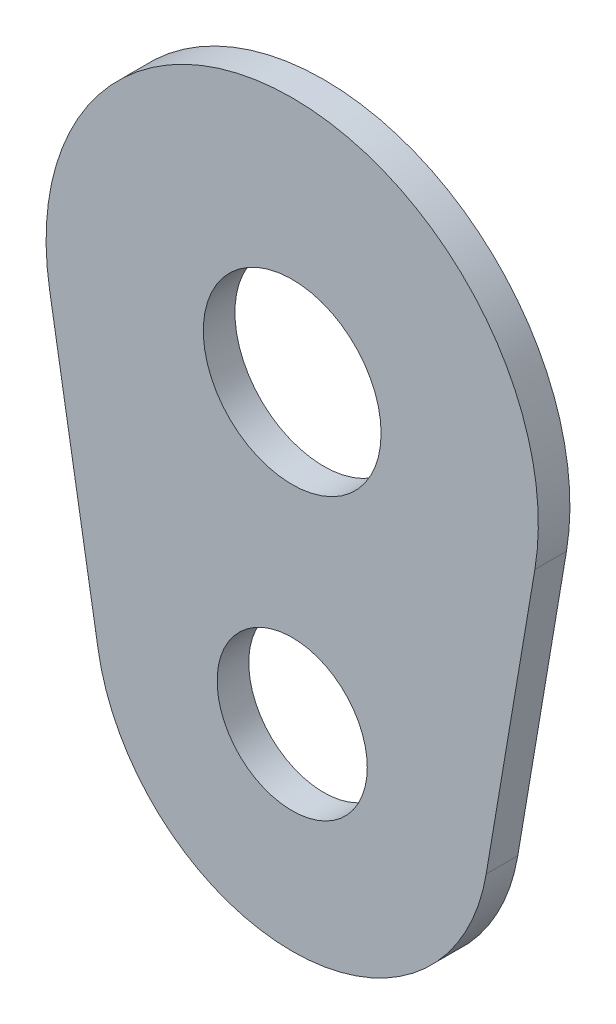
ISO-10303-21;
HEADER;
FILE_DESCRIPTION(('STEP AP214'),'2;1');
FILE_NAME('part.step','',(''),(''),'','','');
FILE_SCHEMA(('AUTOMOTIVE_DESIGN { 1 0 10303 214 1 1 1 1 }'));
ENDSEC;
DATA;
#1=APPLICATION_CONTEXT('core data for automotive mechanical design processes');
#2=APPLICATION_PROTOCOL_DEFINITION('international standard','automotive_design',2000,#1);
#3=PRODUCT_CONTEXT('',#1,'mechanical');
#4=PRODUCT('Part','Part','',(#3));
#5=PRODUCT_RELATED_PRODUCT_CATEGORY('part','',(#4));
#6=PRODUCT_DEFINITION_FORMATION('','',#4);
#7=PRODUCT_DEFINITION_CONTEXT('part definition',#1,'design');
#8=PRODUCT_DEFINITION('design','',#6,#7);
#9=PRODUCT_DEFINITION_SHAPE('','',#8);
#10=(LENGTH_UNIT() NAMED_UNIT(*) SI_UNIT(.MILLI.,.METRE.));
#11=(NAMED_UNIT(*) PLANE_ANGLE_UNIT() SI_UNIT($,.RADIAN.));
#12=(NAMED_UNIT(*) SI_UNIT($,.STERADIAN.) SOLID_ANGLE_UNIT());
#13=UNCERTAINTY_MEASURE_WITH_UNIT(LENGTH_MEASURE(1.E-05),#10,'distance_accuracy_value','');
#14=(GEOMETRIC_REPRESENTATION_CONTEXT(3) GLOBAL_UNCERTAINTY_ASSIGNED_CONTEXT((#13)) GLOBAL_UNIT_ASSIGNED_CONTEXT((#10,
#11,#12)) REPRESENTATION_CONTEXT('',''));
#15=CARTESIAN_POINT('',(0.,0.,0.));
#16=DIRECTION('',(0.,0.,1.));
#17=DIRECTION('',(1.,0.,0.));
#18=AXIS2_PLACEMENT_3D('',#15,#16,#17);
#19=CARTESIAN_POINT('',(2.15105711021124E-13,3.93782229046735E-13,2.032));
#20=DIRECTION('',(0.,0.,-1.));
#21=DIRECTION('',(-1.,0.,0.));
#22=AXIS2_PLACEMENT_3D('',#19,#20,#21);
#23=CYLINDRICAL_SURFACE('',#22,15.8221543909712);
#24=CARTESIAN_POINT('',(2.15105711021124E-13,3.93782229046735E-13,0.));
#25=DIRECTION('',(0.,0.,1.));
#26=DIRECTION('',(1.,0.,0.));
#27=AXIS2_PLACEMENT_3D('',#24,#25,#26);
#28=CIRCLE('',#27,15.8221543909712);
#29=CARTESIAN_POINT('',(15.6008546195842,-2.63702573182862,0.));
#30=VERTEX_POINT('',#29);
#31=CARTESIAN_POINT('',(-15.6008546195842,-2.63702573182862,0.));
#32=VERTEX_POINT('',#31);
#33=EDGE_CURVE('E100',#30,#32,#28,.T.);
#34=ORIENTED_EDGE('',*,*,#33,.T.);
#35=DIRECTION('',(0.,0.,-1.));
#36=VECTOR('',#35,1.);
#37=CARTESIAN_POINT('',(-15.6008546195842,-2.63702573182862,2.032));
#38=LINE('',#37,#36);
#39=CARTESIAN_POINT('',(-15.6008546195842,-2.63702573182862,2.032));
#40=VERTEX_POINT('',#39);
#41=EDGE_CURVE('E11',#40,#32,#38,.T.);
#42=ORIENTED_EDGE('',*,*,#41,.F.);
#43=CARTESIAN_POINT('',(2.15105711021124E-13,3.93782229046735E-13,2.032));
#44=DIRECTION('',(0.,0.,1.));
#45=DIRECTION('',(1.,0.,0.));
#46=AXIS2_PLACEMENT_3D('',#43,#44,#45);
#47=CIRCLE('',#46,15.8221543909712);
#48=CARTESIAN_POINT('',(15.6008546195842,-2.63702573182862,2.032));
#49=VERTEX_POINT('',#48);
#50=EDGE_CURVE('E88',#49,#40,#47,.T.);
#51=ORIENTED_EDGE('',*,*,#50,.F.);
#52=DIRECTION('',(0.,0.,-1.));
#53=VECTOR('',#52,1.);
#54=CARTESIAN_POINT('',(15.6008546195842,-2.63702573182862,2.032));
#55=LINE('',#54,#53);
#56=EDGE_CURVE('E96',#49,#30,#55,.T.);
#57=ORIENTED_EDGE('',*,*,#56,.T.);
#58=EDGE_LOOP('',(#34,#42,#51,#57));
#59=FACE_BOUND('',#58,.T.);
#60=ADVANCED_FACE('F37',(#59),#23,.T.);
#61=CARTESIAN_POINT('',(-15.6008546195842,-2.63702573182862,2.032));
#62=DIRECTION('',(0.986013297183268,0.166666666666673,0.));
#63=DIRECTION('',(-0.166666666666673,0.986013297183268,0.));
#64=AXIS2_PLACEMENT_3D('',#61,#62,#63);
#65=PLANE('',#64);
#66=DIRECTION('',(0.166666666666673,-0.986013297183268,0.));
#67=VECTOR('',#66,1.);
#68=CARTESIAN_POINT('',(-15.6008546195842,-2.63702573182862,0.));
#69=LINE('',#68,#67);
#70=CARTESIAN_POINT('',(-12.470262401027,-21.157859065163,0.));
#71=VERTEX_POINT('',#70);
#72=EDGE_CURVE('E92',#32,#71,#69,.T.);
#73=ORIENTED_EDGE('',*,*,#72,.T.);
#74=DIRECTION('',(0.,0.,-1.));
#75=VECTOR('',#74,1.);
#76=CARTESIAN_POINT('',(-12.470262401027,-21.157859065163,2.032));
#77=LINE('',#76,#75);
#78=CARTESIAN_POINT('',(-12.470262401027,-21.157859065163,2.032));
#79=VERTEX_POINT('',#78);
#80=EDGE_CURVE('E45',#79,#71,#77,.T.);
#81=ORIENTED_EDGE('',*,*,#80,.F.);
#82=DIRECTION('',(0.166666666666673,-0.986013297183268,0.));
#83=VECTOR('',#82,1.);
#84=CARTESIAN_POINT('',(-15.6008546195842,-2.63702573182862,2.032));
#85=LINE('',#84,#83);
#86=EDGE_CURVE('E83',#40,#79,#85,.T.);
#87=ORIENTED_EDGE('',*,*,#86,.F.);
#88=ORIENTED_EDGE('',*,*,#41,.T.);
#89=EDGE_LOOP('',(#73,#81,#87,#88));
#90=FACE_BOUND('',#89,.T.);
#91=ADVANCED_FACE('F91',(#90),#65,.F.);
#92=CARTESIAN_POINT('',(0.,-19.0500000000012,2.032));
#93=DIRECTION('',(0.,0.,-1.));
#94=DIRECTION('',(-1.,0.,0.));
#95=AXIS2_PLACEMENT_3D('',#92,#93,#94);
#96=CYLINDRICAL_SURFACE('',#95,12.6471543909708);
#97=CARTESIAN_POINT('',(0.,-19.0500000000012,0.));
#98=DIRECTION('',(0.,0.,1.));
#99=DIRECTION('',(1.,0.,0.));
#100=AXIS2_PLACEMENT_3D('',#97,#98,#99);
#101=CIRCLE('',#100,12.6471543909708);
#102=CARTESIAN_POINT('',(12.470262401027,-21.157859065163,0.));
#103=VERTEX_POINT('',#102);
#104=EDGE_CURVE('E70',#71,#103,#101,.T.);
#105=ORIENTED_EDGE('',*,*,#104,.T.);
#106=DIRECTION('',(0.,0.,-1.));
#107=VECTOR('',#106,1.);
#108=CARTESIAN_POINT('',(12.470262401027,-21.157859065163,2.032));
#109=LINE('',#108,#107);
#110=CARTESIAN_POINT('',(12.470262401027,-21.157859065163,2.032));
#111=VERTEX_POINT('',#110);
#112=EDGE_CURVE('E93',#111,#103,#109,.T.);
#113=ORIENTED_EDGE('',*,*,#112,.F.);
#114=CARTESIAN_POINT('',(0.,-19.0500000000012,2.032));
#115=DIRECTION('',(0.,0.,1.));
#116=DIRECTION('',(1.,0.,0.));
#117=AXIS2_PLACEMENT_3D('',#114,#115,#116);
#118=CIRCLE('',#117,12.6471543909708);
#119=EDGE_CURVE('E86',#79,#111,#118,.T.);
#120=ORIENTED_EDGE('',*,*,#119,.F.);
#121=ORIENTED_EDGE('',*,*,#80,.T.);
#122=EDGE_LOOP('',(#105,#113,#120,#121));
#123=FACE_BOUND('',#122,.T.);
#124=ADVANCED_FACE('F94',(#123),#96,.T.);
#125=CARTESIAN_POINT('',(12.470262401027,-21.157859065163,2.032));
#126=DIRECTION('',(-0.986013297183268,0.166666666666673,0.));
#127=DIRECTION('',(-0.166666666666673,-0.986013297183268,0.));
#128=AXIS2_PLACEMENT_3D('',#125,#126,#127);
#129=PLANE('',#128);
#130=DIRECTION('',(0.166666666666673,0.986013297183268,0.));
#131=VECTOR('',#130,1.);
#132=CARTESIAN_POINT('',(12.470262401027,-21.157859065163,0.));
#133=LINE('',#132,#131);
#134=EDGE_CURVE('E76',#103,#30,#133,.T.);
#135=ORIENTED_EDGE('',*,*,#134,.T.);
#136=ORIENTED_EDGE('',*,*,#56,.F.);
#137=DIRECTION('',(0.166666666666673,0.986013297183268,0.));
#138=VECTOR('',#137,1.);
#139=CARTESIAN_POINT('',(12.470262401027,-21.157859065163,2.032));
#140=LINE('',#139,#138);
#141=EDGE_CURVE('E53',#111,#49,#140,.T.);
#142=ORIENTED_EDGE('',*,*,#141,.F.);
#143=ORIENTED_EDGE('',*,*,#112,.T.);
#144=EDGE_LOOP('',(#135,#136,#142,#143));
#145=FACE_BOUND('',#144,.T.);
#146=ADVANCED_FACE('F108',(#145),#129,.F.);
#147=CARTESIAN_POINT('',(2.15105711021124E-13,3.93782229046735E-13,2.032));
#148=DIRECTION('',(0.,0.,1.));
#149=DIRECTION('',(1.,0.,0.));
#150=AXIS2_PLACEMENT_3D('',#147,#148,#149);
#151=PLANE('',#150);
#152=CARTESIAN_POINT('',(0.,0.,2.032));
#153=DIRECTION('',(0.,0.,1.));
#154=DIRECTION('',(1.,0.,0.));
#155=AXIS2_PLACEMENT_3D('',#152,#153,#154);
#156=CIRCLE('',#155,5.715);
#157=CARTESIAN_POINT('',(5.715,0.,2.032));
#158=VERTEX_POINT('',#157);
#159=EDGE_CURVE('E120',#158,#158,#156,.T.);
#160=ORIENTED_EDGE('',*,*,#159,.F.);
#161=EDGE_LOOP('',(#160));
#162=FACE_BOUND('',#161,.T.);
#163=CARTESIAN_POINT('',(0.,-19.0500000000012,2.032));
#164=DIRECTION('',(0.,0.,1.));
#165=DIRECTION('',(1.,0.,0.));
#166=AXIS2_PLACEMENT_3D('',#163,#164,#165);
#167=CIRCLE('',#166,4.826);
#168=CARTESIAN_POINT('',(4.826,-19.0500000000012,2.032));
#169=VERTEX_POINT('',#168);
#170=EDGE_CURVE('E114',#169,#169,#167,.T.);
#171=ORIENTED_EDGE('',*,*,#170,.F.);
#172=EDGE_LOOP('',(#171));
#173=FACE_BOUND('',#172,.T.);
#174=ORIENTED_EDGE('',*,*,#50,.T.);
#175=ORIENTED_EDGE('',*,*,#86,.T.);
#176=ORIENTED_EDGE('',*,*,#119,.T.);
#177=ORIENTED_EDGE('',*,*,#141,.T.);
#178=EDGE_LOOP('',(#174,#175,#176,#177));
#179=FACE_BOUND('',#178,.T.);
#180=ADVANCED_FACE('F84',(#162,#173,#179),#151,.T.);
#181=CARTESIAN_POINT('',(2.15105711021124E-13,3.93782229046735E-13,0.));
#182=DIRECTION('',(0.,0.,1.));
#183=DIRECTION('',(1.,0.,0.));
#184=AXIS2_PLACEMENT_3D('',#181,#182,#183);
#185=PLANE('',#184);
#186=CARTESIAN_POINT('',(0.,0.,0.));
#187=DIRECTION('',(0.,0.,1.));
#188=DIRECTION('',(1.,0.,0.));
#189=AXIS2_PLACEMENT_3D('',#186,#187,#188);
#190=CIRCLE('',#189,5.715);
#191=CARTESIAN_POINT('',(5.715,0.,0.));
#192=VERTEX_POINT('',#191);
#193=EDGE_CURVE('E117',#192,#192,#190,.T.);
#194=ORIENTED_EDGE('',*,*,#193,.T.);
#195=EDGE_LOOP('',(#194));
#196=FACE_BOUND('',#195,.T.);
#197=CARTESIAN_POINT('',(0.,-19.0500000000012,0.));
#198=DIRECTION('',(0.,0.,1.));
#199=DIRECTION('',(1.,0.,0.));
#200=AXIS2_PLACEMENT_3D('',#197,#198,#199);
#201=CIRCLE('',#200,4.826);
#202=CARTESIAN_POINT('',(4.826,-19.0500000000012,0.));
#203=VERTEX_POINT('',#202);
#204=EDGE_CURVE('E103',#203,#203,#201,.T.);
#205=ORIENTED_EDGE('',*,*,#204,.T.);
#206=EDGE_LOOP('',(#205));
#207=FACE_BOUND('',#206,.T.);
#208=ORIENTED_EDGE('',*,*,#33,.F.);
#209=ORIENTED_EDGE('',*,*,#134,.F.);
#210=ORIENTED_EDGE('',*,*,#104,.F.);
#211=ORIENTED_EDGE('',*,*,#72,.F.);
#212=EDGE_LOOP('',(#208,#209,#210,#211));
#213=FACE_BOUND('',#212,.T.);
#214=ADVANCED_FACE('F111',(#196,#207,#213),#185,.F.);
#215=CARTESIAN_POINT('',(0.,-19.0500000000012,0.));
#216=DIRECTION('',(0.,0.,1.));
#217=DIRECTION('',(1.,0.,0.));
#218=AXIS2_PLACEMENT_3D('',#215,#216,#217);
#219=CYLINDRICAL_SURFACE('',#218,4.826);
#220=ORIENTED_EDGE('',*,*,#204,.F.);
#221=EDGE_LOOP('',(#220));
#222=FACE_BOUND('',#221,.T.);
#223=ORIENTED_EDGE('',*,*,#170,.T.);
#224=EDGE_LOOP('',(#223));
#225=FACE_BOUND('',#224,.T.);
#226=ADVANCED_FACE('F131',(#222,#225),#219,.F.);
#227=CARTESIAN_POINT('',(0.,0.,0.));
#228=DIRECTION('',(0.,0.,1.));
#229=DIRECTION('',(1.,0.,0.));
#230=AXIS2_PLACEMENT_3D('',#227,#228,#229);
#231=CYLINDRICAL_SURFACE('',#230,5.715);
#232=ORIENTED_EDGE('',*,*,#193,.F.);
#233=EDGE_LOOP('',(#232));
#234=FACE_BOUND('',#233,.T.);
#235=ORIENTED_EDGE('',*,*,#159,.T.);
#236=EDGE_LOOP('',(#235));
#237=FACE_BOUND('',#236,.T.);
#238=ADVANCED_FACE('F128',(#234,#237),#231,.F.);
#239=CLOSED_SHELL('',(#60,#91,#124,#146,#180,#214,#226,#238));
#240=MANIFOLD_SOLID_BREP('B2',#239);
#241=ADVANCED_BREP_SHAPE_REPRESENTATION('',(#18,#240),#14);
#242=SHAPE_DEFINITION_REPRESENTATION(#9,#241);
ENDSEC;
END-ISO-10303-21;
